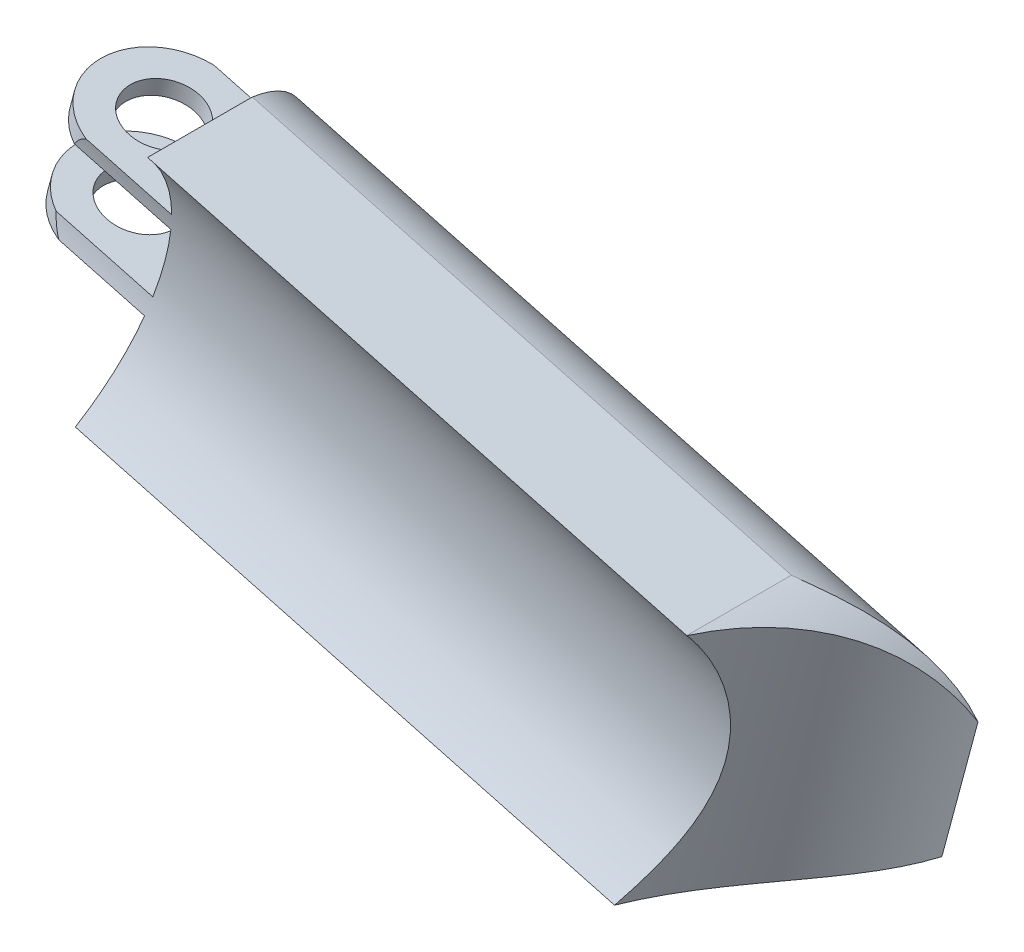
ISO-10303-21;
HEADER;
FILE_DESCRIPTION(('STEP AP214'),'2;1');
FILE_NAME('part.step','',(''),(''),'','','');
FILE_SCHEMA(('AUTOMOTIVE_DESIGN { 1 0 10303 214 1 1 1 1 }'));
ENDSEC;
DATA;
#1=APPLICATION_CONTEXT('core data for automotive mechanical design processes');
#2=APPLICATION_PROTOCOL_DEFINITION('international standard','automotive_design',2000,#1);
#3=PRODUCT_CONTEXT('',#1,'mechanical');
#4=PRODUCT('Part','Part','',(#3));
#5=PRODUCT_RELATED_PRODUCT_CATEGORY('part','',(#4));
#6=PRODUCT_DEFINITION_FORMATION('','',#4);
#7=PRODUCT_DEFINITION_CONTEXT('part definition',#1,'design');
#8=PRODUCT_DEFINITION('design','',#6,#7);
#9=PRODUCT_DEFINITION_SHAPE('','',#8);
#10=(LENGTH_UNIT() NAMED_UNIT(*) SI_UNIT(.MILLI.,.METRE.));
#11=(NAMED_UNIT(*) PLANE_ANGLE_UNIT() SI_UNIT($,.RADIAN.));
#12=(NAMED_UNIT(*) SI_UNIT($,.STERADIAN.) SOLID_ANGLE_UNIT());
#13=UNCERTAINTY_MEASURE_WITH_UNIT(LENGTH_MEASURE(1.E-05),#10,'distance_accuracy_value','');
#14=(GEOMETRIC_REPRESENTATION_CONTEXT(3) GLOBAL_UNCERTAINTY_ASSIGNED_CONTEXT((#13)) GLOBAL_UNIT_ASSIGNED_CONTEXT((#10,
#11,#12)) REPRESENTATION_CONTEXT('',''));
#15=CARTESIAN_POINT('',(0.,0.,0.));
#16=DIRECTION('',(0.,0.,1.));
#17=DIRECTION('',(1.,0.,0.));
#18=AXIS2_PLACEMENT_3D('',#15,#16,#17);
#19=CARTESIAN_POINT('',(-25.7107754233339,7.59368503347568,7.32532187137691));
#20=DIRECTION('',(-0.258819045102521,-0.965925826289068,0.));
#21=DIRECTION('',(0.965925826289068,-0.258819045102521,0.));
#22=AXIS2_PLACEMENT_3D('',#19,#20,#21);
#23=PLANE('',#22);
#24=CARTESIAN_POINT('',(-22.082049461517,6.62137084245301,3.66266093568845));
#25=DIRECTION('',(0.258819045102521,0.965925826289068,0.));
#26=DIRECTION('',(-0.965925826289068,0.258819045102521,0.));
#27=AXIS2_PLACEMENT_3D('',#24,#25,#26);
#28=CIRCLE('',#27,2.);
#29=CARTESIAN_POINT('',(-24.0139011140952,7.13900893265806,3.66266093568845));
#30=VERTEX_POINT('',#29);
#31=EDGE_CURVE('E191',#30,#30,#28,.T.);
#32=ORIENTED_EDGE('',*,*,#31,.F.);
#33=EDGE_LOOP('',(#32));
#34=FACE_BOUND('',#33,.T.);
#35=DIRECTION('',(0.965925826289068,-0.258819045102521,0.));
#36=VECTOR('',#35,1.);
#37=CARTESIAN_POINT('',(-25.7107754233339,7.59368503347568,0.));
#38=LINE('',#37,#36);
#39=CARTESIAN_POINT('',(-22.8890236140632,6.83759891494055,0.));
#40=VERTEX_POINT('',#39);
#41=CARTESIAN_POINT('',(-17.9833688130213,5.52313267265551,0.));
#42=VERTEX_POINT('',#41);
#43=EDGE_CURVE('E264',#40,#42,#38,.T.);
#44=ORIENTED_EDGE('',*,*,#43,.F.);
#45=CARTESIAN_POINT('',(-22.082049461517,6.62137084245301,3.66266093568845));
#46=DIRECTION('',(-0.258819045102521,-0.965925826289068,0.));
#47=DIRECTION('',(-0.965925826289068,0.258819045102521,0.));
#48=AXIS2_PLACEMENT_3D('',#45,#46,#47);
#49=CIRCLE('',#48,3.75673355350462);
#50=CARTESIAN_POINT('',(-22.8890236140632,6.83759891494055,7.32532187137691));
#51=VERTEX_POINT('',#50);
#52=EDGE_CURVE('E213',#51,#40,#49,.T.);
#53=ORIENTED_EDGE('',*,*,#52,.F.);
#54=DIRECTION('',(0.965925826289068,-0.258819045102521,0.));
#55=VECTOR('',#54,1.);
#56=CARTESIAN_POINT('',(-25.7107754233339,7.59368503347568,7.32532187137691));
#57=LINE('',#56,#55);
#58=CARTESIAN_POINT('',(-17.9833688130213,5.52313267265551,7.32532187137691));
#59=VERTEX_POINT('',#58);
#60=EDGE_CURVE('E270',#51,#59,#57,.T.);
#61=ORIENTED_EDGE('',*,*,#60,.T.);
#62=DIRECTION('',(0.,0.,-1.));
#63=VECTOR('',#62,1.);
#64=CARTESIAN_POINT('',(-17.9833688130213,5.52313267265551,7.32532187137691));
#65=LINE('',#64,#63);
#66=EDGE_CURVE('E267',#59,#42,#65,.T.);
#67=ORIENTED_EDGE('',*,*,#66,.T.);
#68=EDGE_LOOP('',(#44,#53,#61,#67));
#69=FACE_BOUND('',#68,.T.);
#70=ADVANCED_FACE('F37',(#34,#69),#23,.F.);
#71=CARTESIAN_POINT('',(-25.9695944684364,6.62775920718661,0.));
#72=DIRECTION('',(0.258819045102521,0.965925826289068,0.));
#73=DIRECTION('',(-0.965925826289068,0.258819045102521,0.));
#74=AXIS2_PLACEMENT_3D('',#71,#72,#73);
#75=PLANE('',#74);
#76=CARTESIAN_POINT('',(-22.3408685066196,5.65544501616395,3.66266093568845));
#77=DIRECTION('',(0.258819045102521,0.965925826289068,0.));
#78=DIRECTION('',(-0.965925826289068,0.258819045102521,0.));
#79=AXIS2_PLACEMENT_3D('',#76,#77,#78);
#80=CIRCLE('',#79,2.);
#81=CARTESIAN_POINT('',(-24.2727201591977,6.17308310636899,3.66266093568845));
#82=VERTEX_POINT('',#81);
#83=EDGE_CURVE('E195',#82,#82,#80,.T.);
#84=ORIENTED_EDGE('',*,*,#83,.T.);
#85=EDGE_LOOP('',(#84));
#86=FACE_BOUND('',#85,.T.);
#87=DIRECTION('',(0.965925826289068,-0.258819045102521,0.));
#88=VECTOR('',#87,1.);
#89=CARTESIAN_POINT('',(-25.9695944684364,6.62775920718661,7.11211234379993));
#90=LINE('',#89,#88);
#91=CARTESIAN_POINT('',(-23.7782271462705,6.04058410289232,7.11211234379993));
#92=VERTEX_POINT('',#91);
#93=CARTESIAN_POINT('',(-18.2421878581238,4.55720684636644,7.11211234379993));
#94=VERTEX_POINT('',#93);
#95=EDGE_CURVE('E274',#92,#94,#90,.T.);
#96=ORIENTED_EDGE('',*,*,#95,.F.);
#97=CARTESIAN_POINT('',(-22.3408685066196,5.65544501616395,3.66266093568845));
#98=DIRECTION('',(0.258819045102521,0.965925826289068,0.));
#99=DIRECTION('',(-0.965925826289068,0.258819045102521,0.));
#100=AXIS2_PLACEMENT_3D('',#97,#98,#99);
#101=CIRCLE('',#100,3.75673355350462);
#102=CARTESIAN_POINT('',(-23.1478426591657,5.87167308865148,0.));
#103=VERTEX_POINT('',#102);
#104=EDGE_CURVE('E233',#92,#103,#101,.F.);
#105=ORIENTED_EDGE('',*,*,#104,.T.);
#106=DIRECTION('',(0.965925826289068,-0.258819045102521,0.));
#107=VECTOR('',#106,1.);
#108=CARTESIAN_POINT('',(-25.9695944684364,6.62775920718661,0.));
#109=LINE('',#108,#107);
#110=CARTESIAN_POINT('',(-18.2421878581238,4.55720684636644,0.));
#111=VERTEX_POINT('',#110);
#112=EDGE_CURVE('E66',#103,#111,#109,.T.);
#113=ORIENTED_EDGE('',*,*,#112,.T.);
#114=DIRECTION('',(0.,0.,1.));
#115=VECTOR('',#114,1.);
#116=CARTESIAN_POINT('',(-18.2421878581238,4.55720684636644,0.));
#117=LINE('',#116,#115);
#118=EDGE_CURVE('E310',#111,#94,#117,.T.);
#119=ORIENTED_EDGE('',*,*,#118,.T.);
#120=EDGE_LOOP('',(#96,#105,#113,#119));
#121=FACE_BOUND('',#120,.T.);
#122=ADVANCED_FACE('F251',(#86,#121),#75,.F.);
#123=CARTESIAN_POINT('',(-27.0048706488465,2.76405590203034,0.));
#124=DIRECTION('',(-0.258819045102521,-0.965925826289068,0.));
#125=DIRECTION('',(0.965925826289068,-0.258819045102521,0.));
#126=AXIS2_PLACEMENT_3D('',#123,#124,#125);
#127=PLANE('',#126);
#128=CARTESIAN_POINT('',(-23.3761446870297,1.79174171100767,3.66266093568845));
#129=DIRECTION('',(-0.258819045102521,-0.965925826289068,0.));
#130=DIRECTION('',(0.965925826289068,-0.258819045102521,0.));
#131=AXIS2_PLACEMENT_3D('',#128,#129,#130);
#132=CIRCLE('',#131,2.);
#133=CARTESIAN_POINT('',(-21.4442930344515,1.27410362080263,3.66266093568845));
#134=VERTEX_POINT('',#133);
#135=EDGE_CURVE('E190',#134,#134,#132,.T.);
#136=ORIENTED_EDGE('',*,*,#135,.T.);
#137=EDGE_LOOP('',(#136));
#138=FACE_BOUND('',#137,.T.);
#139=DIRECTION('',(0.965925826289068,-0.258819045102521,0.));
#140=VECTOR('',#139,1.);
#141=CARTESIAN_POINT('',(-27.0048706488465,2.76405590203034,0.));
#142=LINE('',#141,#140);
#143=CARTESIAN_POINT('',(-24.1831188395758,2.0079697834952,0.));
#144=VERTEX_POINT('',#143);
#145=CARTESIAN_POINT('',(-19.2774640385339,0.693503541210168,0.));
#146=VERTEX_POINT('',#145);
#147=EDGE_CURVE('E315',#144,#146,#142,.T.);
#148=ORIENTED_EDGE('',*,*,#147,.F.);
#149=CARTESIAN_POINT('',(-23.3761446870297,1.79174171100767,3.66266093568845));
#150=DIRECTION('',(-0.258819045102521,-0.965925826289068,0.));
#151=DIRECTION('',(0.965925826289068,-0.258819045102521,0.));
#152=AXIS2_PLACEMENT_3D('',#149,#150,#151);
#153=CIRCLE('',#152,3.75673355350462);
#154=CARTESIAN_POINT('',(-24.8135033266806,2.17688079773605,7.11211234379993));
#155=VERTEX_POINT('',#154);
#156=EDGE_CURVE('E222',#144,#155,#153,.F.);
#157=ORIENTED_EDGE('',*,*,#156,.T.);
#158=DIRECTION('',(0.965925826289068,-0.258819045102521,0.));
#159=VECTOR('',#158,1.);
#160=CARTESIAN_POINT('',(-27.0048706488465,2.76405590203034,7.11211234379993));
#161=LINE('',#160,#159);
#162=CARTESIAN_POINT('',(-19.2774640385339,0.693503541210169,7.11211234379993));
#163=VERTEX_POINT('',#162);
#164=EDGE_CURVE('E318',#155,#163,#161,.T.);
#165=ORIENTED_EDGE('',*,*,#164,.T.);
#166=DIRECTION('',(0.,0.,-1.));
#167=VECTOR('',#166,1.);
#168=CARTESIAN_POINT('',(-19.2774640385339,0.693503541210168,0.));
#169=LINE('',#168,#167);
#170=EDGE_CURVE('E308',#163,#146,#169,.T.);
#171=ORIENTED_EDGE('',*,*,#170,.T.);
#172=EDGE_LOOP('',(#148,#157,#165,#171));
#173=FACE_BOUND('',#172,.T.);
#174=ADVANCED_FACE('F247',(#138,#173),#127,.F.);
#175=CARTESIAN_POINT('',(-27.263689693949,1.79813007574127,7.32532187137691));
#176=DIRECTION('',(0.258819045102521,0.965925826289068,0.));
#177=DIRECTION('',(-0.965925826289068,0.258819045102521,0.));
#178=AXIS2_PLACEMENT_3D('',#175,#176,#177);
#179=PLANE('',#178);
#180=CARTESIAN_POINT('',(-23.6349637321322,0.825815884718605,3.66266093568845));
#181=DIRECTION('',(0.258819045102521,0.965925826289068,0.));
#182=DIRECTION('',(-0.965925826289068,0.258819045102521,0.));
#183=AXIS2_PLACEMENT_3D('',#180,#181,#182);
#184=CIRCLE('',#183,2.);
#185=CARTESIAN_POINT('',(-25.5668153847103,1.34345397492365,3.66266093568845));
#186=VERTEX_POINT('',#185);
#187=EDGE_CURVE('E188',#186,#186,#184,.T.);
#188=ORIENTED_EDGE('',*,*,#187,.T.);
#189=EDGE_LOOP('',(#188));
#190=FACE_BOUND('',#189,.T.);
#191=DIRECTION('',(0.965925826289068,-0.258819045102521,0.));
#192=VECTOR('',#191,1.);
#193=CARTESIAN_POINT('',(-27.263689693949,1.79813007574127,7.32532187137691));
#194=LINE('',#193,#192);
#195=CARTESIAN_POINT('',(-24.4419378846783,1.04204395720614,7.32532187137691));
#196=VERTEX_POINT('',#195);
#197=CARTESIAN_POINT('',(-19.5362830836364,-0.272422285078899,7.32532187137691));
#198=VERTEX_POINT('',#197);
#199=EDGE_CURVE('E58',#196,#198,#194,.T.);
#200=ORIENTED_EDGE('',*,*,#199,.F.);
#201=CARTESIAN_POINT('',(-23.6349637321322,0.825815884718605,3.66266093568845));
#202=DIRECTION('',(0.258819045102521,0.965925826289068,0.));
#203=DIRECTION('',(-0.965925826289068,0.258819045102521,0.));
#204=AXIS2_PLACEMENT_3D('',#201,#202,#203);
#205=CIRCLE('',#204,3.75673355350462);
#206=CARTESIAN_POINT('',(-24.4419378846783,1.04204395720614,0.));
#207=VERTEX_POINT('',#206);
#208=EDGE_CURVE('E219',#196,#207,#205,.F.);
#209=ORIENTED_EDGE('',*,*,#208,.T.);
#210=DIRECTION('',(0.965925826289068,-0.258819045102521,0.));
#211=VECTOR('',#210,1.);
#212=CARTESIAN_POINT('',(-27.263689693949,1.79813007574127,0.));
#213=LINE('',#212,#211);
#214=CARTESIAN_POINT('',(-19.5362830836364,-0.272422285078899,0.));
#215=VERTEX_POINT('',#214);
#216=EDGE_CURVE('E317',#207,#215,#213,.T.);
#217=ORIENTED_EDGE('',*,*,#216,.T.);
#218=DIRECTION('',(0.,0.,1.));
#219=VECTOR('',#218,1.);
#220=CARTESIAN_POINT('',(-19.5362830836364,-0.272422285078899,7.32532187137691));
#221=LINE('',#220,#219);
#222=EDGE_CURVE('E321',#215,#198,#221,.T.);
#223=ORIENTED_EDGE('',*,*,#222,.T.);
#224=EDGE_LOOP('',(#200,#209,#217,#223));
#225=FACE_BOUND('',#224,.T.);
#226=ADVANCED_FACE('F250',(#190,#225),#179,.F.);
#227=CARTESIAN_POINT('',(-16.6892735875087,10.3527618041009,10.));
#228=DIRECTION('',(0.965925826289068,-0.258819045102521,0.));
#229=DIRECTION('',(0.258819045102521,0.965925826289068,0.));
#230=AXIS2_PLACEMENT_3D('',#227,#228,#229);
#231=PLANE('',#230);
#232=ORIENTED_EDGE('',*,*,#170,.F.);
#233=CARTESIAN_POINT('',(-18.7598259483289,2.62535519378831,18.9442719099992));
#234=DIRECTION('',(-0.965925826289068,0.258819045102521,0.));
#235=DIRECTION('',(-0.258819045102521,-0.965925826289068,0.));
#236=AXIS2_PLACEMENT_3D('',#233,#234,#235);
#237=CIRCLE('',#236,12.);
#238=EDGE_CURVE('E281',#94,#163,#237,.T.);
#239=ORIENTED_EDGE('',*,*,#238,.F.);
#240=ORIENTED_EDGE('',*,*,#118,.F.);
#241=DIRECTION('',(-0.258819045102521,-0.965925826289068,0.));
#242=VECTOR('',#241,1.);
#243=CARTESIAN_POINT('',(-16.6892735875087,10.3527618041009,0.));
#244=LINE('',#243,#242);
#245=EDGE_CURVE('E185',#111,#146,#244,.T.);
#246=ORIENTED_EDGE('',*,*,#245,.T.);
#247=EDGE_LOOP('',(#232,#239,#240,#246));
#248=FACE_BOUND('',#247,.T.);
#249=ADVANCED_FACE('F39',(#248),#231,.F.);
#250=ORIENTED_EDGE('',*,*,#222,.F.);
#251=CARTESIAN_POINT('',(-19.795102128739,-1.23834811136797,0.));
#252=VERTEX_POINT('',#251);
#253=EDGE_CURVE('E186',#215,#252,#244,.T.);
#254=ORIENTED_EDGE('',*,*,#253,.T.);
#255=CARTESIAN_POINT('',(-19.5581595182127,-0.354066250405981,4.91547594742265));
#256=DIRECTION('',(0.965925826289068,-0.258819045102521,0.));
#257=DIRECTION('',(0.258819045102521,0.965925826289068,0.));
#258=AXIS2_PLACEMENT_3D('',#255,#256,#257);
#259=CIRCLE('',#258,5.);
#260=CARTESIAN_POINT('',(-20.830378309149,-5.10205141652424,4.));
#261=VERTEX_POINT('',#260);
#262=EDGE_CURVE('E280',#252,#261,#259,.F.);
#263=ORIENTED_EDGE('',*,*,#262,.T.);
#264=DIRECTION('',(0.,0.,-1.));
#265=VECTOR('',#264,1.);
#266=CARTESIAN_POINT('',(-20.830378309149,-5.10205141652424,10.));
#267=LINE('',#266,#265);
#268=CARTESIAN_POINT('',(-20.830378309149,-5.10205141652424,10.));
#269=VERTEX_POINT('',#268);
#270=EDGE_CURVE('E51',#269,#261,#267,.T.);
#271=ORIENTED_EDGE('',*,*,#270,.F.);
#272=EDGE_CURVE('E272',#198,#269,#237,.T.);
#273=ORIENTED_EDGE('',*,*,#272,.F.);
#274=EDGE_LOOP('',(#250,#254,#263,#271,#273));
#275=FACE_BOUND('',#274,.T.);
#276=ADVANCED_FACE('F333',(#275),#231,.F.);
#277=ORIENTED_EDGE('',*,*,#66,.F.);
#278=CARTESIAN_POINT('',(-16.6892735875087,10.3527618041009,10.));
#279=VERTEX_POINT('',#278);
#280=EDGE_CURVE('E278',#279,#59,#237,.T.);
#281=ORIENTED_EDGE('',*,*,#280,.F.);
#282=DIRECTION('',(0.,0.,-1.));
#283=VECTOR('',#282,1.);
#284=CARTESIAN_POINT('',(-16.6892735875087,10.3527618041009,10.));
#285=LINE('',#284,#283);
#286=CARTESIAN_POINT('',(-16.6892735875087,10.3527618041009,3.99999999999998));
#287=VERTEX_POINT('',#286);
#288=EDGE_CURVE('E176',#279,#287,#285,.T.);
#289=ORIENTED_EDGE('',*,*,#288,.T.);
#290=CARTESIAN_POINT('',(-17.961492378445,5.60477663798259,4.91547594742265));
#291=DIRECTION('',(0.965925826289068,-0.258819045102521,0.));
#292=DIRECTION('',(0.258819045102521,0.965925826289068,0.));
#293=AXIS2_PLACEMENT_3D('',#290,#291,#292);
#294=CIRCLE('',#293,5.);
#295=CARTESIAN_POINT('',(-17.7245497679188,6.48905849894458,0.));
#296=VERTEX_POINT('',#295);
#297=EDGE_CURVE('E284',#287,#296,#294,.F.);
#298=ORIENTED_EDGE('',*,*,#297,.T.);
#299=EDGE_CURVE('E182',#296,#42,#244,.T.);
#300=ORIENTED_EDGE('',*,*,#299,.T.);
#301=EDGE_LOOP('',(#277,#281,#289,#298,#300));
#302=FACE_BOUND('',#301,.T.);
#303=ADVANCED_FACE('F456',(#302),#231,.F.);
#304=CARTESIAN_POINT('',(0.,0.,0.));
#305=DIRECTION('',(0.,0.,1.));
#306=DIRECTION('',(1.,0.,0.));
#307=AXIS2_PLACEMENT_3D('',#304,#305,#306);
#308=PLANE('',#307);
#309=ORIENTED_EDGE('',*,*,#216,.F.);
#310=DIRECTION('',(0.258819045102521,0.965925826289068,0.));
#311=VECTOR('',#310,1.);
#312=CARTESIAN_POINT('',(-25.4772140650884,-2.82165934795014,0.));
#313=LINE('',#312,#311);
#314=EDGE_CURVE('E218',#207,#144,#313,.T.);
#315=ORIENTED_EDGE('',*,*,#314,.T.);
#316=ORIENTED_EDGE('',*,*,#147,.T.);
#317=ORIENTED_EDGE('',*,*,#245,.F.);
#318=ORIENTED_EDGE('',*,*,#112,.F.);
#319=EDGE_CURVE('E215',#103,#40,#313,.T.);
#320=ORIENTED_EDGE('',*,*,#319,.T.);
#321=ORIENTED_EDGE('',*,*,#43,.T.);
#322=ORIENTED_EDGE('',*,*,#299,.F.);
#323=DIRECTION('',(0.965925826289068,-0.258819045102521,0.));
#324=VECTOR('',#323,1.);
#325=CARTESIAN_POINT('',(-79.2431060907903,22.9729059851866,0.));
#326=LINE('',#325,#324);
#327=CARTESIAN_POINT('',(20.912483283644,-3.86370330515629,0.));
#328=VERTEX_POINT('',#327);
#329=EDGE_CURVE('E286',#296,#328,#326,.T.);
#330=ORIENTED_EDGE('',*,*,#329,.T.);
#331=DIRECTION('',(0.258819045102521,0.965925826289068,0.));
#332=VECTOR('',#331,1.);
#333=CARTESIAN_POINT('',(17.8066547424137,-15.4548132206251,0.));
#334=LINE('',#333,#332);
#335=CARTESIAN_POINT('',(18.8419309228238,-11.5911099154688,0.));
#336=VERTEX_POINT('',#335);
#337=EDGE_CURVE('E151',#336,#328,#334,.T.);
#338=ORIENTED_EDGE('',*,*,#337,.F.);
#339=DIRECTION('',(0.965925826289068,-0.258819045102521,0.));
#340=VECTOR('',#339,1.);
#341=CARTESIAN_POINT('',(-81.3136584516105,15.245499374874,0.));
#342=LINE('',#341,#340);
#343=EDGE_CURVE('E291',#252,#336,#342,.T.);
#344=ORIENTED_EDGE('',*,*,#343,.F.);
#345=ORIENTED_EDGE('',*,*,#253,.F.);
#346=EDGE_LOOP('',(#309,#315,#316,#317,#318,#320,#321,#322,#330,#338,#344,#345));
#347=FACE_BOUND('',#346,.T.);
#348=ADVANCED_FACE('F312',(#347),#308,.F.);
#349=CARTESIAN_POINT('',(-20.830378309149,-5.10205141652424,10.));
#350=DIRECTION('',(0.258819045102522,0.965925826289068,0.));
#351=DIRECTION('',(-0.965925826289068,0.258819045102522,0.));
#352=AXIS2_PLACEMENT_3D('',#349,#350,#351);
#353=PLANE('',#352);
#354=DIRECTION('',(0.965925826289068,-0.258819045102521,0.));
#355=VECTOR('',#354,1.);
#356=CARTESIAN_POINT('',(-82.3489346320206,11.3817960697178,4.));
#357=LINE('',#356,#355);
#358=CARTESIAN_POINT('',(10.0792481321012,-13.3842608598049,4.00000000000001));
#359=VERTEX_POINT('',#358);
#360=EDGE_CURVE('E293',#261,#359,#357,.T.);
#361=ORIENTED_EDGE('',*,*,#360,.T.);
#362=DIRECTION('',(0.,0.,-1.));
#363=VECTOR('',#362,1.);
#364=CARTESIAN_POINT('',(10.0792481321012,-13.3842608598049,10.));
#365=LINE('',#364,#363);
#366=CARTESIAN_POINT('',(10.0792481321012,-13.3842608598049,10.));
#367=VERTEX_POINT('',#366);
#368=EDGE_CURVE('E171',#367,#359,#365,.T.);
#369=ORIENTED_EDGE('',*,*,#368,.F.);
#370=DIRECTION('',(0.965925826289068,-0.258819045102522,0.));
#371=VECTOR('',#370,1.);
#372=CARTESIAN_POINT('',(-20.830378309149,-5.10205141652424,10.));
#373=LINE('',#372,#371);
#374=EDGE_CURVE('E164',#269,#367,#373,.T.);
#375=ORIENTED_EDGE('',*,*,#374,.F.);
#376=ORIENTED_EDGE('',*,*,#270,.T.);
#377=EDGE_LOOP('',(#361,#369,#375,#376));
#378=FACE_BOUND('',#377,.T.);
#379=ADVANCED_FACE('F332',(#378),#353,.F.);
#380=CARTESIAN_POINT('',(-16.6892735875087,10.3527618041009,10.));
#381=DIRECTION('',(-0.258819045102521,-0.965925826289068,0.));
#382=DIRECTION('',(0.965925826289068,-0.258819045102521,0.));
#383=AXIS2_PLACEMENT_3D('',#380,#381,#382);
#384=PLANE('',#383);
#385=DIRECTION('',(-0.965925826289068,0.258819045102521,0.));
#386=VECTOR('',#385,1.);
#387=CARTESIAN_POINT('',(-16.6892735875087,10.3527618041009,10.));
#388=LINE('',#387,#386);
#389=CARTESIAN_POINT('',(14.2203528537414,2.07055236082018,10.));
#390=VERTEX_POINT('',#389);
#391=EDGE_CURVE('E161',#390,#279,#388,.T.);
#392=ORIENTED_EDGE('',*,*,#391,.F.);
#393=DIRECTION('',(0.,0.,-1.));
#394=VECTOR('',#393,1.);
#395=CARTESIAN_POINT('',(14.2203528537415,2.07055236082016,10.));
#396=LINE('',#395,#394);
#397=CARTESIAN_POINT('',(14.2203528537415,2.07055236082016,4.));
#398=VERTEX_POINT('',#397);
#399=EDGE_CURVE('E155',#390,#398,#396,.T.);
#400=ORIENTED_EDGE('',*,*,#399,.T.);
#401=DIRECTION('',(0.965925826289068,-0.258819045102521,0.));
#402=VECTOR('',#401,1.);
#403=CARTESIAN_POINT('',(-78.2078299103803,26.8366092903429,4.));
#404=LINE('',#403,#402);
#405=EDGE_CURVE('E289',#287,#398,#404,.T.);
#406=ORIENTED_EDGE('',*,*,#405,.F.);
#407=ORIENTED_EDGE('',*,*,#288,.F.);
#408=EDGE_LOOP('',(#392,#400,#406,#407));
#409=FACE_BOUND('',#408,.T.);
#410=ADVANCED_FACE('F174',(#409),#384,.F.);
#411=CARTESIAN_POINT('',(-79.4800487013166,22.0886241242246,4.91547594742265));
#412=DIRECTION('',(0.965925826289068,-0.258819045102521,0.));
#413=DIRECTION('',(0.258819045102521,0.965925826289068,0.));
#414=AXIS2_PLACEMENT_3D('',#411,#412,#413);
#415=CYLINDRICAL_SURFACE('',#414,5.);
#416=CARTESIAN_POINT('',(20.912483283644,-3.86370330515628,0.));
#417=CARTESIAN_POINT('',(20.8183761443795,-3.67536249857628,0.0293698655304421));
#418=CARTESIAN_POINT('',(20.7197730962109,-3.49049091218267,0.0656868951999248));
#419=CARTESIAN_POINT('',(20.5144953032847,-3.1284723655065,0.150463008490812));
#420=CARTESIAN_POINT('',(20.4078312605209,-2.9513156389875,0.198906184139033));
#421=CARTESIAN_POINT('',(20.1880173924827,-2.60645491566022,0.30582253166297));
#422=CARTESIAN_POINT('',(20.0749287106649,-2.43868469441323,0.364209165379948));
#423=CARTESIAN_POINT('',(19.8421056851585,-2.11120212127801,0.489899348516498));
#424=CARTESIAN_POINT('',(19.7223681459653,-1.95149371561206,0.557207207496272));
#425=CARTESIAN_POINT('',(19.4019440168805,-1.54532175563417,0.742897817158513));
#426=CARTESIAN_POINT('',(19.1964548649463,-1.3054015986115,0.867380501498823));
#427=CARTESIAN_POINT('',(18.7720212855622,-0.846913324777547,1.13176602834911));
#428=CARTESIAN_POINT('',(18.5530712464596,-0.628354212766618,1.27167532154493));
#429=CARTESIAN_POINT('',(18.101836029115,-0.210828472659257,1.56430657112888));
#430=CARTESIAN_POINT('',(17.8694681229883,-0.0120099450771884,1.71711147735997));
#431=CARTESIAN_POINT('',(17.394099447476,0.364737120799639,2.03146002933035));
#432=CARTESIAN_POINT('',(17.1511002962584,0.542668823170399,2.1930023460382));
#433=CARTESIAN_POINT('',(16.6941598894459,0.851850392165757,2.49594832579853));
#434=CARTESIAN_POINT('',(16.4816535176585,0.98604204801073,2.63652718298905));
#435=CARTESIAN_POINT('',(16.1576508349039,1.17675951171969,2.84875616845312));
#436=CARTESIAN_POINT('',(16.0487839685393,1.23856633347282,2.91972088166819));
#437=CARTESIAN_POINT('',(15.8292049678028,1.35872814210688,3.06174487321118));
#438=CARTESIAN_POINT('',(15.7184927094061,1.41708289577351,3.13280415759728));
#439=CARTESIAN_POINT('',(15.496339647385,1.52976810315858,3.27372347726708));
#440=CARTESIAN_POINT('',(15.3849208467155,1.584136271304,3.34358803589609));
#441=CARTESIAN_POINT('',(15.1598968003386,1.68963836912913,3.48217807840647));
#442=CARTESIAN_POINT('',(15.0462919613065,1.74077289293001,3.55090376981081));
#443=CARTESIAN_POINT('',(14.8162962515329,1.83998580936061,3.686084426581));
#444=CARTESIAN_POINT('',(14.6999037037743,1.88806229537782,3.752537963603));
#445=CARTESIAN_POINT('',(14.5225245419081,1.95803124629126,3.8487556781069));
#446=CARTESIAN_POINT('',(14.4629133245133,1.98100369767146,3.88026080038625));
#447=CARTESIAN_POINT('',(14.3425428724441,2.02627503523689,3.94155818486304));
#448=CARTESIAN_POINT('',(14.2817832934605,2.0485737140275,3.97134992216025));
#449=CARTESIAN_POINT('',(14.2203528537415,2.07055236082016,3.99999999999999));
#450=B_SPLINE_CURVE_WITH_KNOTS('',3,(#416,#417,#418,#419,#420,#421,#422,#423,#424,#425,#426,
#427,#428,#429,#430,#431,#432,#433,#434,#435,#436,#437,#438,#439,#440,#441,#442,#443,#444,#445,
#446,#447,#448,#449),.UNSPECIFIED.,.F.,.F.,(4,2,2,2,2,2,2,2,2,2,2,2,2,2,2,2,4),(0.,
0.637377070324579,1.27392232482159,1.90518707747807,2.53675789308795,3.55380030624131,
4.57126962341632,5.59587217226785,6.62031930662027,7.48377034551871,7.91543483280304,
8.34712844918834,8.77399308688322,9.20077906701,9.62782858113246,9.84149188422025,
10.0552202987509),.UNSPECIFIED.);
#451=EDGE_CURVE('E168',#328,#398,#450,.T.);
#452=ORIENTED_EDGE('',*,*,#451,.F.);
#453=ORIENTED_EDGE('',*,*,#329,.F.);
#454=ORIENTED_EDGE('',*,*,#297,.F.);
#455=ORIENTED_EDGE('',*,*,#405,.T.);
#456=EDGE_LOOP('',(#452,#453,#454,#455));
#457=FACE_BOUND('',#456,.T.);
#458=ADVANCED_FACE('F343',(#457),#415,.T.);
#459=CARTESIAN_POINT('',(-81.0767158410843,16.129781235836,4.91547594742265));
#460=DIRECTION('',(0.965925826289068,-0.258819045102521,0.));
#461=DIRECTION('',(0.258819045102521,0.965925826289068,0.));
#462=AXIS2_PLACEMENT_3D('',#459,#460,#461);
#463=CYLINDRICAL_SURFACE('',#462,5.);
#464=CARTESIAN_POINT('',(10.0792481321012,-13.3842608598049,4.));
#465=CARTESIAN_POINT('',(10.1582849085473,-13.3986411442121,3.96467471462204));
#466=CARTESIAN_POINT('',(10.2367029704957,-13.4121000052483,3.92768098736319));
#467=CARTESIAN_POINT('',(10.392605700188,-13.4372847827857,3.85128894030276));
#468=CARTESIAN_POINT('',(10.4700907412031,-13.4490114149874,3.81189162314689));
#469=CARTESIAN_POINT('',(10.6244418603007,-13.4708456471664,3.73162225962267));
#470=CARTESIAN_POINT('',(10.7013083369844,-13.4809543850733,3.69075127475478));
#471=CARTESIAN_POINT('',(10.8546908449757,-13.4996267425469,3.60799291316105));
#472=CARTESIAN_POINT('',(10.9312068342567,-13.5081901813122,3.56610541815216));
#473=CARTESIAN_POINT('',(11.1604353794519,-13.5316273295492,3.43949214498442));
#474=CARTESIAN_POINT('',(11.3128499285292,-13.544250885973,3.35380416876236));
#475=CARTESIAN_POINT('',(11.6175856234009,-13.5636630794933,3.18155521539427));
#476=CARTESIAN_POINT('',(11.7699067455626,-13.5704505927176,3.09499407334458));
#477=CARTESIAN_POINT('',(12.0769458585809,-13.5782775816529,2.92071014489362));
#478=CARTESIAN_POINT('',(12.2316667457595,-13.5792327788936,2.83298860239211));
#479=CARTESIAN_POINT('',(12.5414582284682,-13.5751420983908,2.65832642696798));
#480=CARTESIAN_POINT('',(12.6965288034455,-13.5700965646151,2.57138574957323));
#481=CARTESIAN_POINT('',(13.007067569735,-13.5539350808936,2.3988154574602));
#482=CARTESIAN_POINT('',(13.162535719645,-13.5428197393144,2.31318571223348));
#483=CARTESIAN_POINT('',(13.4738640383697,-13.5144215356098,2.14369394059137));
#484=CARTESIAN_POINT('',(13.6297242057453,-13.4971386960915,2.05983190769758));
#485=CARTESIAN_POINT('',(14.0651215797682,-13.4401415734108,1.82888948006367));
#486=CARTESIAN_POINT('',(14.3450728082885,-13.3934934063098,1.68421533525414));
#487=CARTESIAN_POINT('',(14.9055513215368,-13.2792263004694,1.4044191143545));
#488=CARTESIAN_POINT('',(15.1860786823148,-13.2116043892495,1.26929839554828));
#489=CARTESIAN_POINT('',(15.7445872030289,-13.0550805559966,1.0124561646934));
#490=CARTESIAN_POINT('',(16.0225712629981,-12.9663474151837,0.890639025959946));
#491=CARTESIAN_POINT('',(16.5768013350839,-12.7664312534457,0.662537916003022));
#492=CARTESIAN_POINT('',(16.853048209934,-12.6552604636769,0.556245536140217));
#493=CARTESIAN_POINT('',(17.2728917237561,-12.4674853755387,0.408581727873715));
#494=CARTESIAN_POINT('',(17.41778843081,-12.3992048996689,0.360183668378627));
#495=CARTESIAN_POINT('',(17.7062226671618,-12.2560821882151,0.269567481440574));
#496=CARTESIAN_POINT('',(17.8497606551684,-12.1812422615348,0.227347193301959));
#497=CARTESIAN_POINT('',(18.1360404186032,-12.0244498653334,0.149576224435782));
#498=CARTESIAN_POINT('',(18.2787710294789,-11.942454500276,0.114070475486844));
#499=CARTESIAN_POINT('',(18.5621036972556,-11.7717733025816,0.0509120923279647));
#500=CARTESIAN_POINT('',(18.7027039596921,-11.6830821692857,0.0232657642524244));
#501=CARTESIAN_POINT('',(18.8419309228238,-11.5911099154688,0.));
#502=B_SPLINE_CURVE_WITH_KNOTS('',3,(#464,#465,#466,#467,#468,#469,#470,#471,#472,#473,#474,
#475,#476,#477,#478,#479,#480,#481,#482,#483,#484,#485,#486,#487,#488,#489,#490,#491,#492,#493,
#494,#495,#496,#497,#498,#499,#500,#501),.UNSPECIFIED.,.F.,.F.,(4,2,2,2,2,2,2,2,2,2,2,2,2,2,2,2,
2,2,4),(0.,0.263199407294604,0.526289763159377,0.789194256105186,1.05212948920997,
1.57792664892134,2.10382504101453,2.63730515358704,3.17075468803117,3.70415076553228,
4.23754488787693,5.19240088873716,6.14739227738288,7.09499105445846,8.04207466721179,
8.54386047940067,9.0454703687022,9.55032651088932,10.0555865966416),.UNSPECIFIED.);
#503=EDGE_CURVE('E198',#359,#336,#502,.T.);
#504=ORIENTED_EDGE('',*,*,#503,.F.);
#505=ORIENTED_EDGE('',*,*,#360,.F.);
#506=ORIENTED_EDGE('',*,*,#262,.F.);
#507=ORIENTED_EDGE('',*,*,#343,.T.);
#508=EDGE_LOOP('',(#504,#505,#506,#507));
#509=FACE_BOUND('',#508,.T.);
#510=ADVANCED_FACE('F337',(#509),#463,.T.);
#511=CARTESIAN_POINT('',(19.8772071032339,-7.72740661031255,18.9442719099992));
#512=DIRECTION('',(-0.965925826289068,0.258819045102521,0.));
#513=DIRECTION('',(-0.258819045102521,-0.965925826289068,0.));
#514=AXIS2_PLACEMENT_3D('',#511,#512,#513);
#515=CYLINDRICAL_SURFACE('',#514,12.);
#516=ORIENTED_EDGE('',*,*,#374,.T.);
#517=CARTESIAN_POINT('',(10.0792481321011,-13.3842608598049,10.));
#518=CARTESIAN_POINT('',(10.1456995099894,-13.2738501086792,9.88922965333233));
#519=CARTESIAN_POINT('',(10.2130551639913,-13.1613739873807,9.78109159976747));
#520=CARTESIAN_POINT('',(10.3491976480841,-12.9323802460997,9.57022332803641));
#521=CARTESIAN_POINT('',(10.4179839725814,-12.8158640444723,9.46749124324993));
#522=CARTESIAN_POINT('',(10.6260248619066,-12.4602185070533,9.16746091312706));
#523=CARTESIAN_POINT('',(10.7669311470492,-12.2150419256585,8.97837849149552));
#524=CARTESIAN_POINT('',(11.050828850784,-11.7079837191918,8.62233668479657));
#525=CARTESIAN_POINT('',(11.1938273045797,-11.4460217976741,8.45549755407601));
#526=CARTESIAN_POINT('',(11.4781445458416,-10.9072297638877,8.14617871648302));
#527=CARTESIAN_POINT('',(11.6194634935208,-10.6304010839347,8.00369666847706));
#528=CARTESIAN_POINT('',(11.8978062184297,-10.0618940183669,7.74383101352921));
#529=CARTESIAN_POINT('',(12.0348157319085,-9.77017330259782,7.62652452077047));
#530=CARTESIAN_POINT('',(12.3010981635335,-9.17388958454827,7.41872052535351));
#531=CARTESIAN_POINT('',(12.4303710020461,-8.86932645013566,7.32822329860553));
#532=CARTESIAN_POINT('',(12.6780395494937,-8.24995648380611,7.17534513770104));
#533=CARTESIAN_POINT('',(12.796465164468,-7.93518126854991,7.11288492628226));
#534=CARTESIAN_POINT('',(13.0204777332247,-7.29681223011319,7.01657729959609));
#535=CARTESIAN_POINT('',(13.1260661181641,-6.97321939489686,6.98272669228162));
#536=CARTESIAN_POINT('',(13.3146056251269,-6.34670897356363,6.9457226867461));
#537=CARTESIAN_POINT('',(13.3987025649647,-6.04426905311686,6.94028190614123));
#538=CARTESIAN_POINT('',(13.553836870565,-5.43662070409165,6.95400798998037));
#539=CARTESIAN_POINT('',(13.624874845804,-5.13141240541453,6.97317370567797));
#540=CARTESIAN_POINT('',(13.7537755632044,-4.52045948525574,7.03588554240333));
#541=CARTESIAN_POINT('',(13.8116269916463,-4.21471462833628,7.07945248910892));
#542=CARTESIAN_POINT('',(13.9144978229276,-3.60542251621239,7.19044113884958));
#543=CARTESIAN_POINT('',(13.9595172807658,-3.30187525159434,7.25786273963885));
#544=CARTESIAN_POINT('',(14.0360416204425,-2.711734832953,7.41255586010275));
#545=CARTESIAN_POINT('',(14.0680266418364,-2.42495822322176,7.4988957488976));
#546=CARTESIAN_POINT('',(14.1222150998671,-1.85734478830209,7.69209524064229));
#547=CARTESIAN_POINT('',(14.1444145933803,-1.57651040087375,7.79896309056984));
#548=CARTESIAN_POINT('',(14.1803732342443,-1.02279013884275,8.03233083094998));
#549=CARTESIAN_POINT('',(14.1941376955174,-0.749899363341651,8.15881829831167));
#550=CARTESIAN_POINT('',(14.2147508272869,-0.213419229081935,8.43070469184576));
#551=CARTESIAN_POINT('',(14.2215986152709,0.0501689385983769,8.57610602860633));
#552=CARTESIAN_POINT('',(14.2307995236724,0.619695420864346,8.91686226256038));
#553=CARTESIAN_POINT('',(14.2319386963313,0.923195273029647,9.11634078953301));
#554=CARTESIAN_POINT('',(14.2292033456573,1.51137705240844,9.53995765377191));
#555=CARTESIAN_POINT('',(14.2253404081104,1.79610086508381,9.7640379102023));
#556=CARTESIAN_POINT('',(14.2203528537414,2.07055236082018,10.));
#557=B_SPLINE_CURVE_WITH_KNOTS('',3,(#517,#518,#519,#520,#521,#522,#523,#524,#525,#526,#527,
#528,#529,#530,#531,#532,#533,#534,#535,#536,#537,#538,#539,#540,#541,#542,#543,#544,#545,#546,
#547,#548,#549,#550,#551,#552,#553,#554,#555,#556),.UNSPECIFIED.,.F.,.F.,(4,2,2,2,2,2,2,2,2,2,2,
2,2,2,2,2,2,2,2,4),(0.,0.509716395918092,1.019255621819,2.03856324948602,3.06317558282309,
4.0876893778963,5.11529789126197,6.14291697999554,7.1676117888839,8.19219225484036,
9.13284582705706,10.0734554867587,11.0148691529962,11.9562787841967,12.8589256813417,
13.7619359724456,14.6643767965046,15.5669327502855,16.6551009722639,17.7407533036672),.UNSPECIFIED.);
#558=EDGE_CURVE('E149',#367,#390,#557,.T.);
#559=ORIENTED_EDGE('',*,*,#558,.T.);
#560=ORIENTED_EDGE('',*,*,#391,.T.);
#561=ORIENTED_EDGE('',*,*,#280,.T.);
#562=ORIENTED_EDGE('',*,*,#60,.F.);
#563=CARTESIAN_POINT('',(-22.8890236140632,6.83759891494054,7.32532187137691));
#564=CARTESIAN_POINT('',(-22.9516867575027,6.80637345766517,7.3133373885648));
#565=CARTESIAN_POINT('',(-23.0122716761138,6.77146257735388,7.30088644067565));
#566=CARTESIAN_POINT('',(-23.1292106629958,6.69564519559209,7.27556395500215));
#567=CARTESIAN_POINT('',(-23.1855776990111,6.65475831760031,7.26269389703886));
#568=CARTESIAN_POINT('',(-23.2937130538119,6.568700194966,7.23712670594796));
#569=CARTESIAN_POINT('',(-23.3455308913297,6.52359030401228,7.224429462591));
#570=CARTESIAN_POINT('',(-23.4456444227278,6.42946260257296,7.19933366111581));
#571=CARTESIAN_POINT('',(-23.4939364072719,6.38044078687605,7.18693542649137));
#572=CARTESIAN_POINT('',(-23.6120922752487,6.25217794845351,7.15621253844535));
#573=CARTESIAN_POINT('',(-23.679708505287,6.17077600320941,7.13825770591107));
#574=CARTESIAN_POINT('',(-23.8079173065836,6.00229326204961,7.10422999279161));
#575=CARTESIAN_POINT('',(-23.8685083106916,5.91521120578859,7.08815753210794));
#576=CARTESIAN_POINT('',(-23.9838226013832,5.7358942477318,7.05814867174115));
#577=CARTESIAN_POINT('',(-24.0384943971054,5.6436233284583,7.04423062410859));
#578=CARTESIAN_POINT('',(-24.1419618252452,5.45549670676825,7.01893983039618));
#579=CARTESIAN_POINT('',(-24.1907556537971,5.35963991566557,7.00756786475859));
#580=CARTESIAN_POINT('',(-24.3045526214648,5.11926094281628,6.98283114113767));
#581=CARTESIAN_POINT('',(-24.3663792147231,4.97306366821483,6.97104663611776));
#582=CARTESIAN_POINT('',(-24.4789966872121,4.67608277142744,6.95367335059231));
#583=CARTESIAN_POINT('',(-24.529782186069,4.52529695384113,6.94808758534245));
#584=CARTESIAN_POINT('',(-24.6203986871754,4.22073018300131,6.94324736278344));
#585=CARTESIAN_POINT('',(-24.6602532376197,4.06695644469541,6.94397918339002));
#586=CARTESIAN_POINT('',(-24.7288079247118,3.75714743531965,6.95172765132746));
#587=CARTESIAN_POINT('',(-24.7575129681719,3.60111319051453,6.95874152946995));
#588=CARTESIAN_POINT('',(-24.7966368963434,3.33060147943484,6.97612464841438));
#589=CARTESIAN_POINT('',(-24.8099103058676,3.21643779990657,6.98505025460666));
#590=CARTESIAN_POINT('',(-24.829481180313,2.98780447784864,7.00599733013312));
#591=CARTESIAN_POINT('',(-24.8357801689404,2.87333490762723,7.01801812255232));
#592=CARTESIAN_POINT('',(-24.8405698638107,2.64454022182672,7.04495988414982));
#593=CARTESIAN_POINT('',(-24.8390596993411,2.53021512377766,7.0598811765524));
#594=CARTESIAN_POINT('',(-24.8270683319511,2.30244097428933,7.09230029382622));
#595=CARTESIAN_POINT('',(-24.8165921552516,2.18899146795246,7.1097966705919));
#596=CARTESIAN_POINT('',(-24.7812831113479,1.93622056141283,7.15144461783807));
#597=CARTESIAN_POINT('',(-24.7535596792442,1.79737683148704,7.17617607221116));
#598=CARTESIAN_POINT('',(-24.6777804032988,1.52603357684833,7.22724635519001));
#599=CARTESIAN_POINT('',(-24.6298397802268,1.39350276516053,7.25357536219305));
#600=CARTESIAN_POINT('',(-24.5504691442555,1.22827639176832,7.28713253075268));
#601=CARTESIAN_POINT('',(-24.5306319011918,1.19006157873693,7.29494920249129));
#602=CARTESIAN_POINT('',(-24.488312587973,1.11496156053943,7.31034870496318));
#603=CARTESIAN_POINT('',(-24.4658245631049,1.07807960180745,7.31793095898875));
#604=CARTESIAN_POINT('',(-24.4419378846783,1.04204395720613,7.32532187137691));
#605=B_SPLINE_CURVE_WITH_KNOTS('',3,(#563,#564,#565,#566,#567,#568,#569,#570,#571,#572,#573,
#574,#575,#576,#577,#578,#579,#580,#581,#582,#583,#584,#585,#586,#587,#588,#589,#590,#591,#592,
#593,#594,#595,#596,#597,#598,#599,#600,#601,#602,#603,#604),.UNSPECIFIED.,.F.,.F.,(4,2,2,2,2,2,
2,2,2,2,2,2,2,2,2,2,2,2,2,2,4),(0.,0.212770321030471,0.424857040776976,0.634236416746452,
0.843832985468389,1.1653282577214,1.48689511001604,1.81106604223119,2.13533620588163,
2.61219212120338,3.08927989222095,3.56533166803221,4.04117369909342,4.38678766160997,
4.73232610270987,5.07790307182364,5.42328644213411,5.85336395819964,6.28102283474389,
6.41221832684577,6.54371436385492),.UNSPECIFIED.);
#606=EDGE_CURVE('E225',#51,#92,#605,.T.);
#607=ORIENTED_EDGE('',*,*,#606,.T.);
#608=ORIENTED_EDGE('',*,*,#95,.T.);
#609=ORIENTED_EDGE('',*,*,#238,.T.);
#610=ORIENTED_EDGE('',*,*,#164,.F.);
#611=EDGE_CURVE('E223',#155,#196,#605,.T.);
#612=ORIENTED_EDGE('',*,*,#611,.T.);
#613=ORIENTED_EDGE('',*,*,#199,.T.);
#614=ORIENTED_EDGE('',*,*,#272,.T.);
#615=EDGE_LOOP('',(#516,#559,#560,#561,#562,#607,#608,#609,#610,#612,#613,#614));
#616=FACE_BOUND('',#615,.T.);
#617=ADVANCED_FACE('F158',(#616),#515,.F.);
#618=CARTESIAN_POINT('',(-24.6702399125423,-3.03788742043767,3.66266093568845));
#619=DIRECTION('',(0.258819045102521,0.965925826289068,0.));
#620=DIRECTION('',(-0.965925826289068,0.258819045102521,0.));
#621=AXIS2_PLACEMENT_3D('',#618,#619,#620);
#622=CYLINDRICAL_SURFACE('',#621,3.75673355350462);
#623=ORIENTED_EDGE('',*,*,#314,.F.);
#624=ORIENTED_EDGE('',*,*,#208,.F.);
#625=ORIENTED_EDGE('',*,*,#611,.F.);
#626=ORIENTED_EDGE('',*,*,#156,.F.);
#627=EDGE_LOOP('',(#623,#624,#625,#626));
#628=FACE_BOUND('',#627,.T.);
#629=ADVANCED_FACE('F244',(#628),#622,.T.);
#630=ORIENTED_EDGE('',*,*,#104,.F.);
#631=ORIENTED_EDGE('',*,*,#606,.F.);
#632=ORIENTED_EDGE('',*,*,#52,.T.);
#633=ORIENTED_EDGE('',*,*,#319,.F.);
#634=EDGE_LOOP('',(#630,#631,#632,#633));
#635=FACE_BOUND('',#634,.T.);
#636=ADVANCED_FACE('F238',(#635),#622,.T.);
#637=CARTESIAN_POINT('',(-24.6702399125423,-3.03788742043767,3.66266093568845));
#638=DIRECTION('',(0.258819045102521,0.965925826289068,0.));
#639=DIRECTION('',(-0.965925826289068,0.258819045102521,0.));
#640=AXIS2_PLACEMENT_3D('',#637,#638,#639);
#641=CYLINDRICAL_SURFACE('',#640,2.);
#642=ORIENTED_EDGE('',*,*,#187,.F.);
#643=EDGE_LOOP('',(#642));
#644=FACE_BOUND('',#643,.T.);
#645=ORIENTED_EDGE('',*,*,#135,.F.);
#646=EDGE_LOOP('',(#645));
#647=FACE_BOUND('',#646,.T.);
#648=ADVANCED_FACE('F243',(#644,#647),#641,.F.);
#649=ORIENTED_EDGE('',*,*,#31,.T.);
#650=EDGE_LOOP('',(#649));
#651=FACE_BOUND('',#650,.T.);
#652=ORIENTED_EDGE('',*,*,#83,.F.);
#653=EDGE_LOOP('',(#652));
#654=FACE_BOUND('',#653,.T.);
#655=ADVANCED_FACE('F246',(#651,#654),#641,.F.);
#656=CARTESIAN_POINT('',(10.1783293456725,-9.22821066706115,10.));
#657=DIRECTION('',(0.,0.,-1.));
#658=DIRECTION('',(-1.,0.,0.));
#659=AXIS2_PLACEMENT_3D('',#656,#657,#658);
#660=CYLINDRICAL_SURFACE('',#659,12.);
#661=ORIENTED_EDGE('',*,*,#399,.F.);
#662=CARTESIAN_POINT('',(14.2203528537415,2.07055236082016,9.99999999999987));
#663=CARTESIAN_POINT('',(14.2939085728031,2.04422486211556,9.75778389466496));
#664=CARTESIAN_POINT('',(14.3721250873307,2.01544654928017,9.51724600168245));
#665=CARTESIAN_POINT('',(14.5375203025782,1.95236941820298,9.03997562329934));
#666=CARTESIAN_POINT('',(14.6247000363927,1.9180699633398,8.80324358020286));
#667=CARTESIAN_POINT('',(14.8078257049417,1.84326370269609,8.33362695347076));
#668=CARTESIAN_POINT('',(14.9037886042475,1.80274477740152,8.10075088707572));
#669=CARTESIAN_POINT('',(15.1038539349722,1.7148756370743,7.63987975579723));
#670=CARTESIAN_POINT('',(15.2079560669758,1.66752567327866,7.41188451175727));
#671=CARTESIAN_POINT('',(15.5333488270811,1.51337976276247,6.73265209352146));
#672=CARTESIAN_POINT('',(15.7664370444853,1.3949883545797,6.2894565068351));
#673=CARTESIAN_POINT('',(16.1351768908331,1.18983460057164,5.64493169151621));
#674=CARTESIAN_POINT('',(16.2612306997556,1.11688375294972,5.43353358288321));
#675=CARTESIAN_POINT('',(16.5189273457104,0.960975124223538,5.01796191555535));
#676=CARTESIAN_POINT('',(16.6505694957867,0.878018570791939,4.81378747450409));
#677=CARTESIAN_POINT('',(16.964450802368,0.671031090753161,4.34464262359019));
#678=CARTESIAN_POINT('',(17.1485688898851,0.542666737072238,4.08281670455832));
#679=CARTESIAN_POINT('',(17.5225261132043,0.264787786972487,3.57493493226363));
#680=CARTESIAN_POINT('',(17.7123649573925,0.115274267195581,3.32887827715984));
#681=CARTESIAN_POINT('',(18.093323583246,-0.205218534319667,2.8556771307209));
#682=CARTESIAN_POINT('',(18.2844258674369,-0.376044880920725,2.62841537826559));
#683=CARTESIAN_POINT('',(18.6656306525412,-0.74085083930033,2.19236130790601));
#684=CARTESIAN_POINT('',(18.8557332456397,-0.934828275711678,1.98356725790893));
#685=CARTESIAN_POINT('',(19.2146670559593,-1.32826265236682,1.60294292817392));
#686=CARTESIAN_POINT('',(19.383906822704,-1.52576414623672,1.42947700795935));
#687=CARTESIAN_POINT('',(19.7151899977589,-1.93995963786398,1.09945747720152));
#688=CARTESIAN_POINT('',(19.8772343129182,-2.15665120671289,0.942901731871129));
#689=CARTESIAN_POINT('',(20.1931062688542,-2.6114262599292,0.644975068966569));
#690=CARTESIAN_POINT('',(20.3467986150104,-2.84975259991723,0.50382970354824));
#691=CARTESIAN_POINT('',(20.5670951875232,-3.22036101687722,0.305205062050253));
#692=CARTESIAN_POINT('',(20.6388489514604,-3.34614038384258,0.24115443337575));
#693=CARTESIAN_POINT('',(20.7785818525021,-3.60185455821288,0.11736345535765));
#694=CARTESIAN_POINT('',(20.8465608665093,-3.73178950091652,0.0576232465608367));
#695=CARTESIAN_POINT('',(20.912483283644,-3.86370330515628,0.));
#696=B_SPLINE_CURVE_WITH_KNOTS('',3,(#662,#663,#664,#665,#666,#667,#668,#669,#670,#671,#672,
#673,#674,#675,#676,#677,#678,#679,#680,#681,#682,#683,#684,#685,#686,#687,#688,#689,#690,#691,
#692,#693,#694,#695),.UNSPECIFIED.,.F.,.F.,(4,2,2,2,2,2,2,2,2,2,2,2,2,2,2,2,4),(0.,
0.763454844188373,1.52699778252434,2.29204793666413,3.05706996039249,4.59777666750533,
5.36762987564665,6.13738872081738,7.17094733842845,8.20445335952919,9.23092914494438,
10.2573085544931,11.1941182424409,12.1308095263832,13.0797600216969,13.5546426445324,
14.0295407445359),.UNSPECIFIED.);
#697=EDGE_CURVE('E146',#390,#328,#696,.T.);
#698=ORIENTED_EDGE('',*,*,#697,.T.);
#699=ORIENTED_EDGE('',*,*,#451,.T.);
#700=EDGE_LOOP('',(#661,#698,#699));
#701=FACE_BOUND('',#700,.T.);
#702=ADVANCED_FACE('F167',(#701),#660,.T.);
#703=CARTESIAN_POINT('',(12.2281346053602,-1.57823329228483,10.));
#704=DIRECTION('',(0.,0.,-1.));
#705=DIRECTION('',(-1.,0.,0.));
#706=AXIS2_PLACEMENT_3D('',#703,#704,#705);
#707=CYLINDRICAL_SURFACE('',#706,12.);
#708=ORIENTED_EDGE('',*,*,#503,.T.);
#709=CARTESIAN_POINT('',(18.8419309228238,-11.5911099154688,0.));
#710=CARTESIAN_POINT('',(18.7168658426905,-11.6737223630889,0.0585680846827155));
#711=CARTESIAN_POINT('',(18.5909831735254,-11.7535017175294,0.119323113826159));
#712=CARTESIAN_POINT('',(18.3379945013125,-11.9073922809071,0.245287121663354));
#713=CARTESIAN_POINT('',(18.2108885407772,-11.9815036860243,0.31049594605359));
#714=CARTESIAN_POINT('',(17.828553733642,-12.1952220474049,0.512816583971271));
#715=CARTESIAN_POINT('',(17.5720973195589,-12.326351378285,0.65672029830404));
#716=CARTESIAN_POINT('',(17.0617624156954,-12.5652631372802,0.961413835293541));
#717=CARTESIAN_POINT('',(16.807880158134,-12.6732298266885,1.12205403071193));
#718=CARTESIAN_POINT('',(16.3038038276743,-12.8681378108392,1.46093914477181));
#719=CARTESIAN_POINT('',(16.0536100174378,-12.9550776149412,1.63918531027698));
#720=CARTESIAN_POINT('',(15.560327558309,-13.10919950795,2.0123357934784));
#721=CARTESIAN_POINT('',(15.3172285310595,-13.1764119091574,2.20721395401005));
#722=CARTESIAN_POINT('',(14.8403102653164,-13.2930451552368,2.61294309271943));
#723=CARTESIAN_POINT('',(14.6064910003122,-13.3424660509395,2.8237940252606));
#724=CARTESIAN_POINT('',(14.1497711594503,-13.4256514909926,3.26081557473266));
#725=CARTESIAN_POINT('',(13.9268943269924,-13.4593832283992,3.48701716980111));
#726=CARTESIAN_POINT('',(13.4942355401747,-13.5132459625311,3.95312501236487));
#727=CARTESIAN_POINT('',(13.2844548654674,-13.5333756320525,4.19303259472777));
#728=CARTESIAN_POINT('',(12.8073876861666,-13.5674034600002,4.77260238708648));
#729=CARTESIAN_POINT('',(12.546075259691,-13.5765635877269,5.1174809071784));
#730=CARTESIAN_POINT('',(12.0517885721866,-13.5794853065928,5.82712530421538));
#731=CARTESIAN_POINT('',(11.8188264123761,-13.5732403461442,6.19189957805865));
#732=CARTESIAN_POINT('',(11.3825085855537,-13.5503942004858,6.93829884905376));
#733=CARTESIAN_POINT('',(11.1791486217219,-13.5337945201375,7.3199213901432));
#734=CARTESIAN_POINT('',(10.8026379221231,-13.4947673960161,8.0972678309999));
#735=CARTESIAN_POINT('',(10.6294718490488,-13.4723429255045,8.49298444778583));
#736=CARTESIAN_POINT('',(10.399804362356,-13.4383526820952,9.07669921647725));
#737=CARTESIAN_POINT('',(10.3312461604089,-13.4275466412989,9.26008476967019));
#738=CARTESIAN_POINT('',(10.2005174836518,-13.4058761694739,9.62864736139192));
#739=CARTESIAN_POINT('',(10.1383329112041,-13.3950119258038,9.81381940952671));
#740=CARTESIAN_POINT('',(10.0792481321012,-13.3842608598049,9.99999999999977));
#741=B_SPLINE_CURVE_WITH_KNOTS('',3,(#709,#710,#711,#712,#713,#714,#715,#716,#717,#718,#719,
#720,#721,#722,#723,#724,#725,#726,#727,#728,#729,#730,#731,#732,#733,#734,#735,#736,#737,#738,
#739,#740),.UNSPECIFIED.,.F.,.F.,(4,2,2,2,2,2,2,2,2,2,2,2,2,2,2,4),(0.,0.482682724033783,
0.965348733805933,1.929873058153,2.88641390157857,3.84302253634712,4.79815349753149,
5.75328172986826,6.71039831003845,7.66760826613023,8.96411457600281,10.2611723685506,
11.5580417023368,12.8542503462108,13.442397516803,14.0292143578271),.UNSPECIFIED.);
#742=EDGE_CURVE('E11',#336,#367,#741,.T.);
#743=ORIENTED_EDGE('',*,*,#742,.T.);
#744=ORIENTED_EDGE('',*,*,#368,.T.);
#745=EDGE_LOOP('',(#708,#743,#744));
#746=FACE_BOUND('',#745,.T.);
#747=ADVANCED_FACE('F339',(#746),#707,.T.);
#748=CARTESIAN_POINT('',(26.6315913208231,-17.8194478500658,15.5089973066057));
#749=DIRECTION('',(0.258819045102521,0.965925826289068,0.));
#750=DIRECTION('',(-0.965925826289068,0.258819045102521,0.));
#751=AXIS2_PLACEMENT_3D('',#748,#749,#750);
#752=CYLINDRICAL_SURFACE('',#751,18.);
#753=ORIENTED_EDGE('',*,*,#558,.F.);
#754=ORIENTED_EDGE('',*,*,#742,.F.);
#755=ORIENTED_EDGE('',*,*,#337,.T.);
#756=ORIENTED_EDGE('',*,*,#697,.F.);
#757=EDGE_LOOP('',(#753,#754,#755,#756));
#758=FACE_BOUND('',#757,.T.);
#759=ADVANCED_FACE('F148',(#758),#752,.F.);
#760=CLOSED_SHELL('',(#70,#122,#174,#226,#249,#276,#303,#348,#379,#410,#458,#510,#617,#629,#636,
#648,#655,#702,#747,#759));
#761=MANIFOLD_SOLID_BREP('B2',#760);
#762=ADVANCED_BREP_SHAPE_REPRESENTATION('',(#18,#761),#14);
#763=SHAPE_DEFINITION_REPRESENTATION(#9,#762);
ENDSEC;
END-ISO-10303-21;
